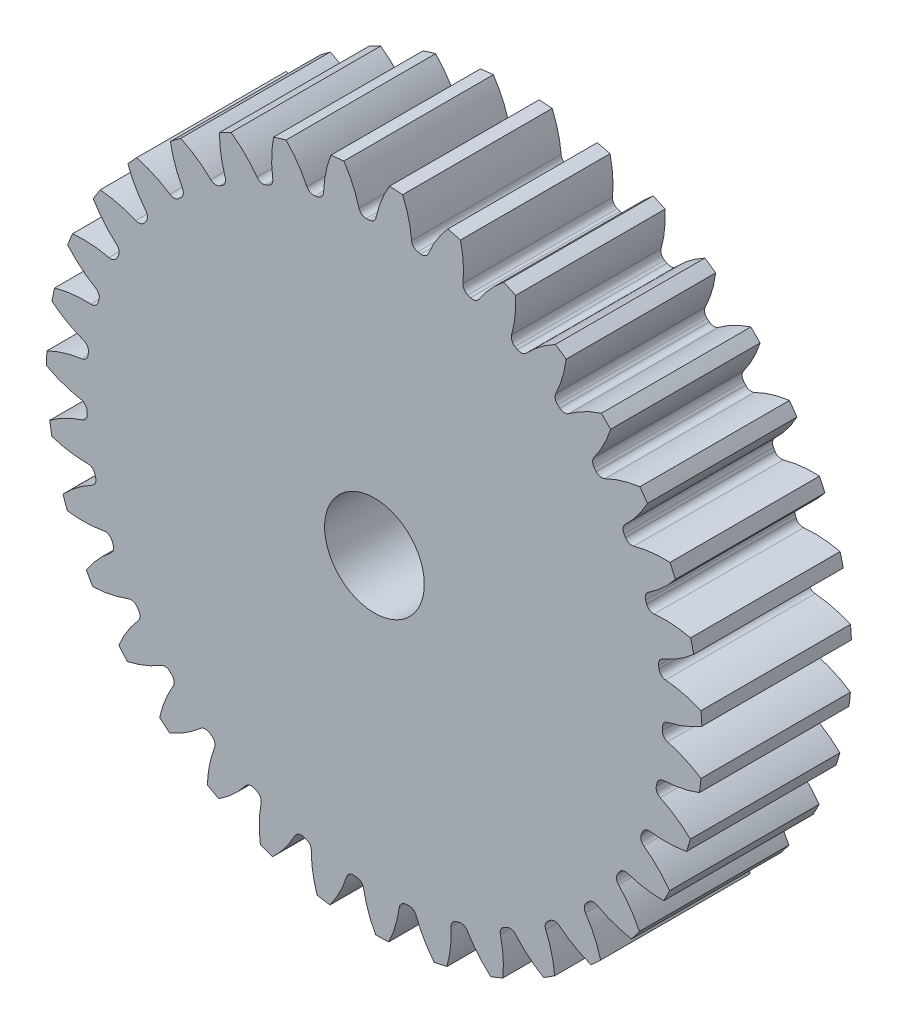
from build123d import *

# Parameters (mm, degrees)
SKETCH3_R         = 208.844444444
GEARBODY_DEPTH    = 95.25
TOOTHCUT_DEPTH    = 311.329770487
CIRPATTERN1_COUNT = 35
BOREDIA_R         = 31.75
BORE_DEPTH        = 12700


with BuildPart() as part:
    # Sketch3 → gearBody (new body)
    with BuildSketch(Plane.XY):
        Circle(SKETCH3_R)
    extrude(amount=GEARBODY_DEPTH)

    # Sketch2 → toothCut (cut, through all)
    with BuildSketch(Plane.XY):
        with BuildLine():
            ThreePointArc((183.38077151, -4.832891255), (183.402807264, -3.908258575), (183.420180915, -2.983526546))
            ThreePointArc((183.420180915, -2.983526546), (184.452994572, -0.155097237), (187.015309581, 1.426439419))
            ThreePointArc((187.015309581, 1.426439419), (198.29758506, 4.942270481), (208.844444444, 10.272801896))
            ThreePointArc((208.844444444, 10.272801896), (209.049485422, -4.45478156), (208.217234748, -19.160260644))
            ThreePointArc((208.217234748, -19.160260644), (197.907030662, -13.385271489), (186.784771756, -9.392006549))
            ThreePointArc((186.784771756, -9.392006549), (184.292156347, -7.702750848), (183.38077151, -4.832891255))
        make_face()
    toothcut = extrude(amount=TOOTHCUT_DEPTH, mode=Mode.SUBTRACT)

    # CirPattern1: toothCut ×35 about axis
    cirpattern1_axis = Axis((0, 0, 0), (0, 0, 1))
    for i in range(1, CIRPATTERN1_COUNT):
        add(toothcut.rotate(cirpattern1_axis, i * 360 / CIRPATTERN1_COUNT), mode=Mode.SUBTRACT)

    # boreDia → bore (cut, symmetric)
    with BuildSketch(Plane.XY):
        Circle(BOREDIA_R)
    extrude(amount=BORE_DEPTH, both=True, mode=Mode.SUBTRACT)


solid = part.part
